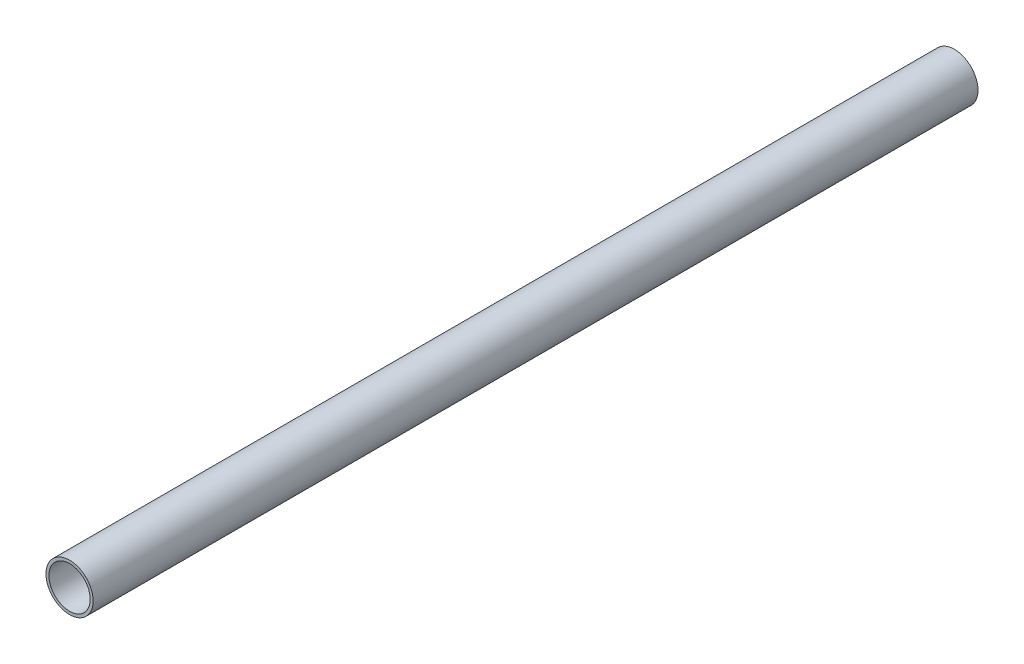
ISO-10303-21;
HEADER;
FILE_DESCRIPTION(('STEP AP214'),'2;1');
FILE_NAME('part.step','',(''),(''),'','','');
FILE_SCHEMA(('AUTOMOTIVE_DESIGN { 1 0 10303 214 1 1 1 1 }'));
ENDSEC;
DATA;
#1=APPLICATION_CONTEXT('core data for automotive mechanical design processes');
#2=APPLICATION_PROTOCOL_DEFINITION('international standard','automotive_design',2000,#1);
#3=PRODUCT_CONTEXT('',#1,'mechanical');
#4=PRODUCT('Part','Part','',(#3));
#5=PRODUCT_RELATED_PRODUCT_CATEGORY('part','',(#4));
#6=PRODUCT_DEFINITION_FORMATION('','',#4);
#7=PRODUCT_DEFINITION_CONTEXT('part definition',#1,'design');
#8=PRODUCT_DEFINITION('design','',#6,#7);
#9=PRODUCT_DEFINITION_SHAPE('','',#8);
#10=(LENGTH_UNIT() NAMED_UNIT(*) SI_UNIT(.MILLI.,.METRE.));
#11=(NAMED_UNIT(*) PLANE_ANGLE_UNIT() SI_UNIT($,.RADIAN.));
#12=(NAMED_UNIT(*) SI_UNIT($,.STERADIAN.) SOLID_ANGLE_UNIT());
#13=UNCERTAINTY_MEASURE_WITH_UNIT(LENGTH_MEASURE(1.E-05),#10,'distance_accuracy_value','');
#14=(GEOMETRIC_REPRESENTATION_CONTEXT(3) GLOBAL_UNCERTAINTY_ASSIGNED_CONTEXT((#13)) GLOBAL_UNIT_ASSIGNED_CONTEXT((#10,
#11,#12)) REPRESENTATION_CONTEXT('',''));
#15=CARTESIAN_POINT('',(0.,0.,0.));
#16=DIRECTION('',(0.,0.,1.));
#17=DIRECTION('',(1.,0.,0.));
#18=AXIS2_PLACEMENT_3D('',#15,#16,#17);
#19=CARTESIAN_POINT('',(0.,0.,300.));
#20=DIRECTION('',(0.,0.,1.));
#21=DIRECTION('',(1.,0.,0.));
#22=AXIS2_PLACEMENT_3D('',#19,#20,#21);
#23=PLANE('',#22);
#24=CARTESIAN_POINT('',(0.,0.,300.));
#25=DIRECTION('',(0.,0.,1.));
#26=DIRECTION('',(1.,0.,0.));
#27=AXIS2_PLACEMENT_3D('',#24,#25,#26);
#28=CIRCLE('',#27,8.);
#29=CARTESIAN_POINT('',(8.,0.,300.));
#30=VERTEX_POINT('',#29);
#31=EDGE_CURVE('E10',#30,#30,#28,.T.);
#32=ORIENTED_EDGE('',*,*,#31,.T.);
#33=EDGE_LOOP('',(#32));
#34=FACE_BOUND('',#33,.T.);
#35=CARTESIAN_POINT('',(0.,0.,300.));
#36=DIRECTION('',(0.,0.,1.));
#37=DIRECTION('',(1.,0.,0.));
#38=AXIS2_PLACEMENT_3D('',#35,#36,#37);
#39=CIRCLE('',#38,7.);
#40=CARTESIAN_POINT('',(7.,0.,300.));
#41=VERTEX_POINT('',#40);
#42=EDGE_CURVE('E46',#41,#41,#39,.T.);
#43=ORIENTED_EDGE('',*,*,#42,.F.);
#44=EDGE_LOOP('',(#43));
#45=FACE_BOUND('',#44,.T.);
#46=ADVANCED_FACE('F35',(#34,#45),#23,.T.);
#47=CARTESIAN_POINT('',(0.,0.,0.));
#48=DIRECTION('',(0.,0.,1.));
#49=DIRECTION('',(1.,0.,0.));
#50=AXIS2_PLACEMENT_3D('',#47,#48,#49);
#51=PLANE('',#50);
#52=CARTESIAN_POINT('',(0.,0.,0.));
#53=DIRECTION('',(0.,0.,1.));
#54=DIRECTION('',(1.,0.,0.));
#55=AXIS2_PLACEMENT_3D('',#52,#53,#54);
#56=CIRCLE('',#55,8.);
#57=CARTESIAN_POINT('',(8.,0.,0.));
#58=VERTEX_POINT('',#57);
#59=EDGE_CURVE('E39',#58,#58,#56,.T.);
#60=ORIENTED_EDGE('',*,*,#59,.F.);
#61=EDGE_LOOP('',(#60));
#62=FACE_BOUND('',#61,.T.);
#63=CARTESIAN_POINT('',(0.,0.,0.));
#64=DIRECTION('',(0.,0.,1.));
#65=DIRECTION('',(1.,0.,0.));
#66=AXIS2_PLACEMENT_3D('',#63,#64,#65);
#67=CIRCLE('',#66,7.);
#68=CARTESIAN_POINT('',(7.,0.,0.));
#69=VERTEX_POINT('',#68);
#70=EDGE_CURVE('E48',#69,#69,#67,.T.);
#71=ORIENTED_EDGE('',*,*,#70,.T.);
#72=EDGE_LOOP('',(#71));
#73=FACE_BOUND('',#72,.T.);
#74=ADVANCED_FACE('F58',(#62,#73),#51,.F.);
#75=CARTESIAN_POINT('',(0.,0.,300.));
#76=DIRECTION('',(0.,0.,-1.));
#77=DIRECTION('',(-1.,0.,0.));
#78=AXIS2_PLACEMENT_3D('',#75,#76,#77);
#79=CYLINDRICAL_SURFACE('',#78,8.);
#80=ORIENTED_EDGE('',*,*,#31,.F.);
#81=EDGE_LOOP('',(#80));
#82=FACE_BOUND('',#81,.T.);
#83=ORIENTED_EDGE('',*,*,#59,.T.);
#84=EDGE_LOOP('',(#83));
#85=FACE_BOUND('',#84,.T.);
#86=ADVANCED_FACE('F37',(#82,#85),#79,.T.);
#87=CARTESIAN_POINT('',(0.,0.,300.));
#88=DIRECTION('',(0.,0.,-1.));
#89=DIRECTION('',(-1.,0.,0.));
#90=AXIS2_PLACEMENT_3D('',#87,#88,#89);
#91=CYLINDRICAL_SURFACE('',#90,7.);
#92=ORIENTED_EDGE('',*,*,#42,.T.);
#93=EDGE_LOOP('',(#92));
#94=FACE_BOUND('',#93,.T.);
#95=ORIENTED_EDGE('',*,*,#70,.F.);
#96=EDGE_LOOP('',(#95));
#97=FACE_BOUND('',#96,.T.);
#98=ADVANCED_FACE('F54',(#94,#97),#91,.F.);
#99=CLOSED_SHELL('',(#46,#74,#86,#98));
#100=MANIFOLD_SOLID_BREP('B2',#99);
#101=ADVANCED_BREP_SHAPE_REPRESENTATION('',(#18,#100),#14);
#102=SHAPE_DEFINITION_REPRESENTATION(#9,#101);
ENDSEC;
END-ISO-10303-21;
